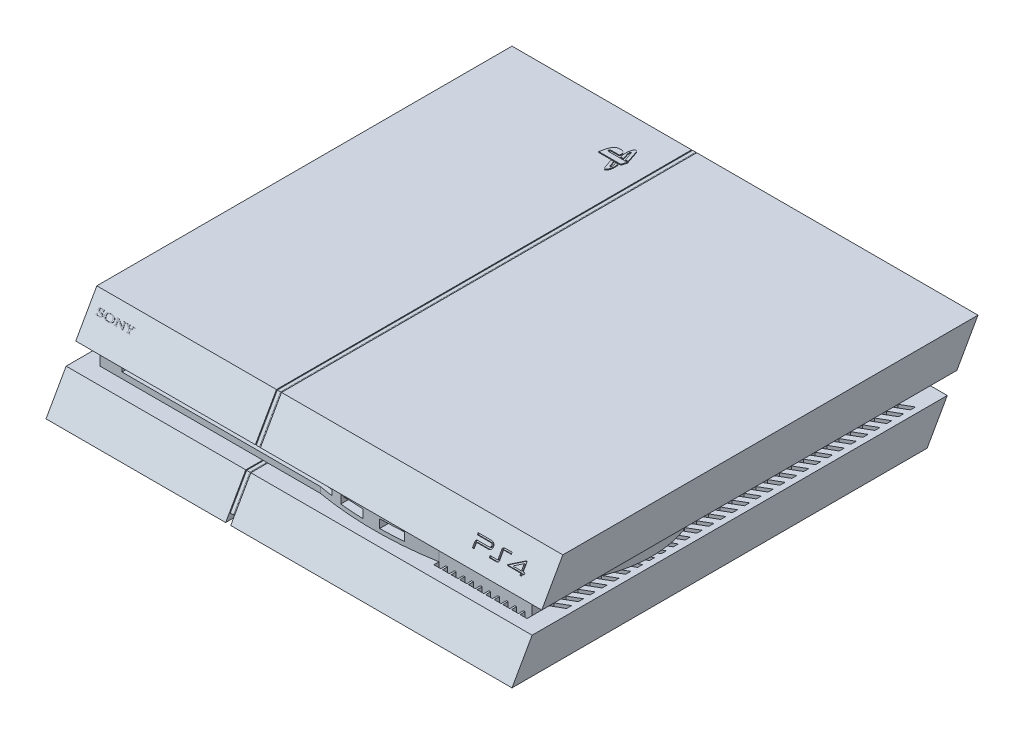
from build123d import *

# Parameters (mm, degrees)
SKETCH1_W               = 275
SKETCH1_H               = 275
BOSS_EXTRUDE1_DEPTH     = 26.5
CUT_EXTRUDE1_DEPTH      = 309.599254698
CUT_EXTRUDE2_DEPTH      = 309.599254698
SKETCH4_W               = 10
SKETCH4_H               = 10
CUT_EXTRUDE3_DEPTH      = 300
BOSS_EXTRUDE2_DEPTH     = 10
FILLET1_R               = 10
BOSS_EXTRUDE9_DEPTH     = 10
CUT_EXTRUDE4_DEPTH      = 20.5
CUT_EXTRUDE4_DEPTH_BACK = 25
SKETCH6_W               = 14
SKETCH6_H               = 5
CUT_EXTRUDE5_DEPTH      = 10.5
CUT_EXTRUDE5_DEPTH_BACK = 150
SKETCH7_W               = 125
SKETCH7_H               = 3
SKETCH8_W               = 3
SKETCH8_H               = 22
SKETCH8_H_2             = 21
CUT_EXTRUDE6_DEPTH      = 187
CUT_EXTRUDE7_DEPTH      = 250
BOSS_EXTRUDE3_DEPTH     = 106
BOSS_EXTRUDE4_DEPTH     = 1.4
BOSS_EXTRUDE4_2_DEPTH   = 1.4
FILLET2_R               = 0.5
FILLET3_R               = 0.5
BOSS_EXTRUDE5_DEPTH     = 0.1
BOSS_EXTRUDE5_2_DEPTH   = 0.1
BOSS_EXTRUDE5_3_DEPTH   = 0.1
BOSS_EXTRUDE5_4_DEPTH   = 0.1
CUT_EXTRUDE8_DEPTH      = 1
SKETCH15_W              = 14
SKETCH15_H              = 2.5
BOSS_EXTRUDE7_DEPTH     = 25
BOSS_EXTRUDE7_2_DEPTH   = 25
BOSS_EXTRUDE8_DEPTH     = 0.5
BOSS_EXTRUDE8_2_DEPTH   = 0.5
BOSS_EXTRUDE8_3_DEPTH   = 0.5
SKETCH18_W              = 4.090909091
SKETCH18_H              = 3
SKETCH18_W_2            = 4.09090909
CUT_EXTRUDE9_DEPTH      = 10.5
CUT_EXTRUDE10_DEPTH     = 10.5
LPATTERN1_COUNT         = 30
LPATTERN1_PITCH         = 7
MIRROR1_COPY_1_DEPTH    = 10.5
MIRROR1_COPY_2_DEPTH    = 10.5
MIRROR1_COPY_3_DEPTH    = 10.5
MIRROR1_COPY_4_DEPTH    = 10.5
MIRROR1_COPY_5_DEPTH    = 10.5
MIRROR1_COPY_6_DEPTH    = 10.5
MIRROR1_COPY_7_DEPTH    = 10.5
MIRROR1_COPY_8_DEPTH    = 10.5
MIRROR1_COPY_9_DEPTH    = 10.5
MIRROR1_COPY_10_DEPTH   = 10.5
MIRROR1_COPY_11_DEPTH   = 10.5
MIRROR1_COPY_12_DEPTH   = 10.5
MIRROR1_COPY_13_DEPTH   = 10.5
MIRROR1_COPY_14_DEPTH   = 10.5
MIRROR1_COPY_15_DEPTH   = 10.5
MIRROR1_COPY_16_DEPTH   = 10.5
MIRROR1_COPY_17_DEPTH   = 10.5
MIRROR1_COPY_18_DEPTH   = 10.5
MIRROR1_COPY_19_DEPTH   = 10.5
MIRROR1_COPY_20_DEPTH   = 10.5
MIRROR1_COPY_21_DEPTH   = 10.5
MIRROR1_COPY_22_DEPTH   = 10.5
MIRROR1_COPY_23_DEPTH   = 10.5
MIRROR1_COPY_24_DEPTH   = 10.5
MIRROR1_COPY_25_DEPTH   = 10.5
MIRROR1_COPY_26_DEPTH   = 10.5
MIRROR1_COPY_27_DEPTH   = 10.5
MIRROR1_COPY_28_DEPTH   = 10.5
MIRROR1_COPY_29_DEPTH   = 10.5
BOSS_EXTRUDE10_DEPTH    = 2
SKETCH21_W              = 150
SKETCH21_H              = 2
BOSS_EXTRUDE11_DEPTH    = 1.25
SKETCH22_W              = 14
SKETCH22_H              = 3
CUT_EXTRUDE11_DEPTH     = 10
LPATTERN2_COUNT         = 16
LPATTERN2_PITCH         = 15.5


with BuildPart() as part:
    # Sketch1 → Boss-Extrude1 (new, symmetric)
    with BuildSketch(Plane(origin=(0, 0, 0), x_dir=(1, 0, 0), z_dir=(0, 1, 0))):
        Rectangle(SKETCH1_W, SKETCH1_H)
    extrude(amount=BOSS_EXTRUDE1_DEPTH, both=True)

    # Sketch2 → Cut-Extrude1 (cut, through all)
    with BuildSketch(Plane(origin=(137.5, 0, 0), x_dir=(0, 0, -1), z_dir=(1, 0, 0))):
        Polygon((-137.5, -26.5), (-107.5, 26.5), (-137.5, 26.5), align=None)
        Polygon((137.5, 26.5), (107.5, -26.5), (137.5, -26.5), align=None)
    extrude(amount=-CUT_EXTRUDE1_DEPTH, mode=Mode.SUBTRACT)

    # Sketch3 → Cut-Extrude2 (cut, through all)
    with BuildSketch(Plane(origin=(137.5, 0, 0), x_dir=(0, 0, -1), z_dir=(1, 0, 0))):
        Polygon((-119.952830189, 4.5), (-115.613207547, 4.5), (-115.613207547, -5.5), (-125.613207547, -5.5), align=None)
        Polygon((125.047169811, 4.5), (119.386792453, -5.5), (115.047169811, -5.5), (115.047169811, 4.5), align=None)
    extrude(amount=-CUT_EXTRUDE2_DEPTH, mode=Mode.SUBTRACT)

    # Sketch4 → Cut-Extrude3 (cut, symmetric)
    with BuildSketch(Plane.XY):
        with Locations((-132.5, -0.5)):
            Rectangle(SKETCH4_W, SKETCH4_H)
        with Locations((132.5, -0.5)):
            Rectangle(SKETCH4_W, SKETCH4_H)
    extrude(amount=CUT_EXTRUDE3_DEPTH, both=True, mode=Mode.SUBTRACT)

    # Sketch5 → Boss-Extrude2 (add)
    with BuildSketch(Plane(origin=(0, -5.5, 0), x_dir=(1, 0, 0), z_dir=(0, 1, 0))):
        with BuildLine():
            Line((127.5, -74.952830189), (127.5, -24.952830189))
            ThreePointArc((127.5, -24.952830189), (132.5, -49.952830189), (127.5, -74.952830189))
        make_face()
    extrude(amount=BOSS_EXTRUDE2_DEPTH)

    # Fillet1
    fillet1_edges = [part.edges().sort_by_distance(p)[0] for p in [
        (127.5, -0.5, 74.952830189),
        (127.5, -0.5, 24.952830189),
    ]]
    fillet(fillet1_edges, radius=FILLET1_R)

    # Sketch17 → Boss-Extrude9 (add)
    with BuildSketch(Plane(origin=(0, -5.5, 0), x_dir=(1, 0, 0), z_dir=(0, 1, 0))):
        with BuildLine():
            Line((2.5, -115.613207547), (72.5, -115.613207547))
            ThreePointArc((72.5, -115.613207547), (37.5, -118.613207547), (2.5, -115.613207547))
        make_face()
    extrude(amount=BOSS_EXTRUDE9_DEPTH)

    # Sketch6 → Cut-Extrude4 (cut, two sides: drawn at the far end of the back side and taken through both)
    with BuildSketch(Plane.XY.offset(115.613207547).offset(-CUT_EXTRUDE4_DEPTH_BACK)):
        with Locations((23.5, -0.5)):
            Rectangle(SKETCH6_W, SKETCH6_H)
        with Locations((47.5, -0.5)):
            Rectangle(SKETCH6_W, SKETCH6_H)
    extrude(amount=CUT_EXTRUDE4_DEPTH + CUT_EXTRUDE4_DEPTH_BACK, mode=Mode.SUBTRACT)

    # Sketch7 → Cut-Extrude5 (cut, two sides: drawn at the far end of the back side and taken through both)
    with BuildSketch(Plane.XY.offset(115.613207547).offset(-CUT_EXTRUDE5_DEPTH_BACK)):
        with Locations((-52, -0.5)):
            Rectangle(SKETCH7_W, SKETCH7_H)
    extrude(amount=CUT_EXTRUDE5_DEPTH + CUT_EXTRUDE5_DEPTH_BACK, mode=Mode.SUBTRACT)

    # Sketch8 → Cut-Extrude6 (cut, symmetric)
    with BuildSketch(Plane.XY):
        with Locations((-30, 15.5)):
            Rectangle(SKETCH8_W, SKETCH8_H)
        with Locations((-30, -16)):
            Rectangle(SKETCH8_W, SKETCH8_H_2)
    extrude(amount=CUT_EXTRUDE6_DEPTH, both=True, mode=Mode.SUBTRACT)

    # Sketch9 → Cut-Extrude7 (cut)
    with BuildSketch(Plane(origin=(-31.5, 0, 0), x_dir=(0, 0, -1), z_dir=(1, 0, 0))):
        Polygon((137.5, 26.5), (-107.5, 26.5), (-119.952830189, 4.5), (-115.613207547, 4.5), (115.047169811, 4.5), (125.047169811, 4.5), align=None)
    extrude(amount=-CUT_EXTRUDE7_DEPTH, mode=Mode.SUBTRACT)

    # Sketch13 → Cut-Extrude8 (cut)
    # profile 1 of 3: a face of its own
    with BuildSketch(Plane(origin=(0, 52.514154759, 92.77500674), x_dir=(1, 0, 0), z_dir=(0, 0.49259821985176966, 0.8702568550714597))):
        with BuildLine():
            Line((92.5, -39.892501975), (100.5, -39.892501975))
            ThreePointArc((100.5, -39.892501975), (102.5, -41.892501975), (100.5, -43.892501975))
            Line((100.5, -43.892501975), (93.7, -43.892501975))
            ThreePointArc((93.7, -43.892501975), (93.558578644, -43.951080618), (93.5, -44.092501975))
            Line((93.5, -44.092501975), (93.5, -46.892501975))
            Line((93.5, -46.892501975), (92.5, -46.892501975))
            Line((92.5, -46.892501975), (92.5, -44.092501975))
            ThreePointArc((92.5, -44.092501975), (92.851471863, -43.243973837), (93.7, -42.892501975))
            Line((93.7, -42.892501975), (100.5, -42.892501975))
            ThreePointArc((100.5, -42.892501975), (101.5, -41.892501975), (100.5, -40.892501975))
            Line((100.5, -40.892501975), (92.5, -40.892501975))
            Line((92.5, -40.892501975), (92.5, -39.892501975))
        make_face()
    # profile 2 of 3: a face of its own
    with BuildSketch(Plane(origin=(0, 52.514154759, 92.77500674), x_dir=(1, 0, 0), z_dir=(0, 0.49259821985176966, 0.8702568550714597))):
        with BuildLine():
            Line((112.5, -39.892501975), (108.2, -39.892501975))
            ThreePointArc((108.2, -39.892501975), (107.351471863, -40.243973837), (107, -41.092501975))
            Line((107, -41.092501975), (107, -45.692501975))
            ThreePointArc((107, -45.692501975), (106.941421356, -45.833923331), (106.8, -45.892501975))
            Line((106.8, -45.892501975), (102.5, -45.892501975))
            Line((102.5, -45.892501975), (102.5, -46.892501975))
            Line((102.5, -46.892501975), (106.8, -46.892501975))
            ThreePointArc((106.8, -46.892501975), (107.648528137, -46.541030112), (108, -45.692501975))
            Line((108, -45.692501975), (108, -41.092501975))
            ThreePointArc((108, -41.092501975), (108.058578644, -40.951080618), (108.2, -40.892501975))
            Line((108.2, -40.892501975), (112.5, -40.892501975))
            Line((112.5, -40.892501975), (112.5, -39.892501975))
        make_face()
    # profile 3 of 3: a face of its own
    with BuildSketch(Plane(origin=(0, 52.514154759, 92.77500674), x_dir=(1, 0, 0), z_dir=(0, 0.49259821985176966, 0.8702568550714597))):
        with BuildLine():
            Line((121.190865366, -39.924902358), (112.590865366, -45.524902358))
            ThreePointArc((112.590865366, -45.524902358), (112.508271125, -45.749423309), (112.7, -45.892501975))
            Line((112.7, -45.892501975), (120.5, -45.892501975))
            Line((120.5, -45.892501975), (120.5, -46.892501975))
            Line((120.5, -46.892501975), (121.5, -46.892501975))
            Line((121.5, -46.892501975), (121.5, -45.892501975))
            Line((121.5, -45.892501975), (122.5, -45.892501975))
            Line((122.5, -45.892501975), (122.5, -44.892501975))
            Line((122.5, -44.892501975), (121.5, -44.892501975))
            Line((121.5, -44.892501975), (121.5, -40.092501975))
            ThreePointArc((121.5, -40.092501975), (121.395323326, -39.916679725), (121.190865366, -39.924902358))
        make_face()
        Polygon((120.5, -41.568088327), (115.39465047, -44.892501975), (120.5, -44.892501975), align=None, mode=Mode.SUBTRACT)
    extrude(amount=-CUT_EXTRUDE8_DEPTH, mode=Mode.SUBTRACT)

    # Sketch18 → Cut-Extrude9 (cut)
    with BuildSketch(Plane(origin=(0, -5.5, 0), x_dir=(1, 0, 0), z_dir=(0, 1, 0))):
        with Locations((74.545454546, -117.113207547)):
            Rectangle(SKETCH18_W, SKETCH18_H)
        with Locations((79.636363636, -117.113207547)):
            Rectangle(SKETCH18_W, SKETCH18_H)
        with Locations((84.727272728, -117.113207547)):
            Rectangle(SKETCH18_W, SKETCH18_H)
        with Locations((89.818181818, -117.113207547)):
            Rectangle(SKETCH18_W, SKETCH18_H)
        with Locations((94.90909091, -117.113207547)):
            Rectangle(SKETCH18_W, SKETCH18_H)
        with Locations((100, -117.113207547)):
            Rectangle(SKETCH18_W_2, SKETCH18_H)
        with Locations((105.090909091, -117.113207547)):
            Rectangle(SKETCH18_W, SKETCH18_H)
        with Locations((110.181818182, -117.113207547)):
            Rectangle(SKETCH18_W, SKETCH18_H)
        with Locations((115.272727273, -117.113207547)):
            Rectangle(SKETCH18_W, SKETCH18_H)
        with Locations((120.363636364, -117.113207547)):
            Rectangle(SKETCH18_W, SKETCH18_H)
        with Locations((125.454545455, -117.113207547)):
            Rectangle(SKETCH18_W, SKETCH18_H)
    extrude(amount=-CUT_EXTRUDE9_DEPTH, mode=Mode.SUBTRACT)

    # Sketch19 → Cut-Extrude10 (cut)
    with BuildSketch(Plane(origin=(0, -5.5, 0), x_dir=(1, 0, 0), z_dir=(0, 1, 0))):
        Polygon((127.5, -102.613207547), (134, -98.860430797), (134, -101.860430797), (127.5, -105.613207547), align=None)
    cut_extrude10 = extrude(amount=-CUT_EXTRUDE10_DEPTH, mode=Mode.SUBTRACT)

    # LPattern1: Cut-Extrude10 ×30
    with Locations(*[(0, 0, -i * LPATTERN1_PITCH) for i in range(1, LPATTERN1_COUNT)]):
        add(cut_extrude10, mode=Mode.SUBTRACT)

    # Mirror1: Cut-Extrude10 across plane
    add(cut_extrude10.mirror(Plane(origin=(0, 0, 0), x_dir=(0, 0, 1), z_dir=(1, 0, 0))), mode=Mode.SUBTRACT)

    # Mirror1 copy 1 sketch → Mirror1 copy 1 (cut)
    with BuildSketch(Plane(origin=(0, -5.5, -7), x_dir=(-1, 0, 0), z_dir=(0, 1, 0))):
        Polygon((127.5, 102.613207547), (134, 98.860430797), (134, 101.860430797), (127.5, 105.613207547), align=None)
    extrude(amount=-MIRROR1_COPY_1_DEPTH, mode=Mode.SUBTRACT)

    # Mirror1 copy 2 sketch → Mirror1 copy 2 (cut)
    with BuildSketch(Plane(origin=(0, -5.5, -14), x_dir=(-1, 0, 0), z_dir=(0, 1, 0))):
        Polygon((127.5, 102.613207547), (134, 98.860430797), (134, 101.860430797), (127.5, 105.613207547), align=None)
    extrude(amount=-MIRROR1_COPY_2_DEPTH, mode=Mode.SUBTRACT)

    # Mirror1 copy 3 sketch → Mirror1 copy 3 (cut)
    with BuildSketch(Plane(origin=(0, -5.5, -21), x_dir=(-1, 0, 0), z_dir=(0, 1, 0))):
        Polygon((127.5, 102.613207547), (134, 98.860430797), (134, 101.860430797), (127.5, 105.613207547), align=None)
    extrude(amount=-MIRROR1_COPY_3_DEPTH, mode=Mode.SUBTRACT)

    # Mirror1 copy 4 sketch → Mirror1 copy 4 (cut)
    with BuildSketch(Plane(origin=(0, -5.5, -28), x_dir=(-1, 0, 0), z_dir=(0, 1, 0))):
        Polygon((127.5, 102.613207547), (134, 98.860430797), (134, 101.860430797), (127.5, 105.613207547), align=None)
    extrude(amount=-MIRROR1_COPY_4_DEPTH, mode=Mode.SUBTRACT)

    # Mirror1 copy 5 sketch → Mirror1 copy 5 (cut)
    with BuildSketch(Plane(origin=(0, -5.5, -35), x_dir=(-1, 0, 0), z_dir=(0, 1, 0))):
        Polygon((127.5, 102.613207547), (134, 98.860430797), (134, 101.860430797), (127.5, 105.613207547), align=None)
    extrude(amount=-MIRROR1_COPY_5_DEPTH, mode=Mode.SUBTRACT)

    # Mirror1 copy 6 sketch → Mirror1 copy 6 (cut)
    with BuildSketch(Plane(origin=(0, -5.5, -42), x_dir=(-1, 0, 0), z_dir=(0, 1, 0))):
        Polygon((127.5, 102.613207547), (134, 98.860430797), (134, 101.860430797), (127.5, 105.613207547), align=None)
    extrude(amount=-MIRROR1_COPY_6_DEPTH, mode=Mode.SUBTRACT)

    # Mirror1 copy 7 sketch → Mirror1 copy 7 (cut)
    with BuildSketch(Plane(origin=(0, -5.5, -49), x_dir=(-1, 0, 0), z_dir=(0, 1, 0))):
        Polygon((127.5, 102.613207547), (134, 98.860430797), (134, 101.860430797), (127.5, 105.613207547), align=None)
    extrude(amount=-MIRROR1_COPY_7_DEPTH, mode=Mode.SUBTRACT)

    # Mirror1 copy 8 sketch → Mirror1 copy 8 (cut)
    with BuildSketch(Plane(origin=(0, -5.5, -56), x_dir=(-1, 0, 0), z_dir=(0, 1, 0))):
        Polygon((127.5, 102.613207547), (134, 98.860430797), (134, 101.860430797), (127.5, 105.613207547), align=None)
    extrude(amount=-MIRROR1_COPY_8_DEPTH, mode=Mode.SUBTRACT)

    # Mirror1 copy 9 sketch → Mirror1 copy 9 (cut)
    with BuildSketch(Plane(origin=(0, -5.5, -63), x_dir=(-1, 0, 0), z_dir=(0, 1, 0))):
        Polygon((127.5, 102.613207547), (134, 98.860430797), (134, 101.860430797), (127.5, 105.613207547), align=None)
    extrude(amount=-MIRROR1_COPY_9_DEPTH, mode=Mode.SUBTRACT)

    # Mirror1 copy 10 sketch → Mirror1 copy 10 (cut)
    with BuildSketch(Plane(origin=(0, -5.5, -70), x_dir=(-1, 0, 0), z_dir=(0, 1, 0))):
        Polygon((127.5, 102.613207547), (134, 98.860430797), (134, 101.860430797), (127.5, 105.613207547), align=None)
    extrude(amount=-MIRROR1_COPY_10_DEPTH, mode=Mode.SUBTRACT)

    # Mirror1 copy 11 sketch → Mirror1 copy 11 (cut)
    with BuildSketch(Plane(origin=(0, -5.5, -77), x_dir=(-1, 0, 0), z_dir=(0, 1, 0))):
        Polygon((127.5, 102.613207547), (134, 98.860430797), (134, 101.860430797), (127.5, 105.613207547), align=None)
    extrude(amount=-MIRROR1_COPY_11_DEPTH, mode=Mode.SUBTRACT)

    # Mirror1 copy 12 sketch → Mirror1 copy 12 (cut)
    with BuildSketch(Plane(origin=(0, -5.5, -84), x_dir=(-1, 0, 0), z_dir=(0, 1, 0))):
        Polygon((127.5, 102.613207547), (134, 98.860430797), (134, 101.860430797), (127.5, 105.613207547), align=None)
    extrude(amount=-MIRROR1_COPY_12_DEPTH, mode=Mode.SUBTRACT)

    # Mirror1 copy 13 sketch → Mirror1 copy 13 (cut)
    with BuildSketch(Plane(origin=(0, -5.5, -91), x_dir=(-1, 0, 0), z_dir=(0, 1, 0))):
        Polygon((127.5, 102.613207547), (134, 98.860430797), (134, 101.860430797), (127.5, 105.613207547), align=None)
    extrude(amount=-MIRROR1_COPY_13_DEPTH, mode=Mode.SUBTRACT)

    # Mirror1 copy 14 sketch → Mirror1 copy 14 (cut)
    with BuildSketch(Plane(origin=(0, -5.5, -98), x_dir=(-1, 0, 0), z_dir=(0, 1, 0))):
        Polygon((127.5, 102.613207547), (134, 98.860430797), (134, 101.860430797), (127.5, 105.613207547), align=None)
    extrude(amount=-MIRROR1_COPY_14_DEPTH, mode=Mode.SUBTRACT)

    # Mirror1 copy 15 sketch → Mirror1 copy 15 (cut)
    with BuildSketch(Plane(origin=(0, -5.5, -105), x_dir=(-1, 0, 0), z_dir=(0, 1, 0))):
        Polygon((127.5, 102.613207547), (134, 98.860430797), (134, 101.860430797), (127.5, 105.613207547), align=None)
    extrude(amount=-MIRROR1_COPY_15_DEPTH, mode=Mode.SUBTRACT)

    # Mirror1 copy 16 sketch → Mirror1 copy 16 (cut)
    with BuildSketch(Plane(origin=(0, -5.5, -112), x_dir=(-1, 0, 0), z_dir=(0, 1, 0))):
        Polygon((127.5, 102.613207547), (134, 98.860430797), (134, 101.860430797), (127.5, 105.613207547), align=None)
    extrude(amount=-MIRROR1_COPY_16_DEPTH, mode=Mode.SUBTRACT)

    # Mirror1 copy 17 sketch → Mirror1 copy 17 (cut)
    with BuildSketch(Plane(origin=(0, -5.5, -119), x_dir=(-1, 0, 0), z_dir=(0, 1, 0))):
        Polygon((127.5, 102.613207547), (134, 98.860430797), (134, 101.860430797), (127.5, 105.613207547), align=None)
    extrude(amount=-MIRROR1_COPY_17_DEPTH, mode=Mode.SUBTRACT)

    # Mirror1 copy 18 sketch → Mirror1 copy 18 (cut)
    with BuildSketch(Plane(origin=(0, -5.5, -126), x_dir=(-1, 0, 0), z_dir=(0, 1, 0))):
        Polygon((127.5, 102.613207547), (134, 98.860430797), (134, 101.860430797), (127.5, 105.613207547), align=None)
    extrude(amount=-MIRROR1_COPY_18_DEPTH, mode=Mode.SUBTRACT)

    # Mirror1 copy 19 sketch → Mirror1 copy 19 (cut)
    with BuildSketch(Plane(origin=(0, -5.5, -133), x_dir=(-1, 0, 0), z_dir=(0, 1, 0))):
        Polygon((127.5, 102.613207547), (134, 98.860430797), (134, 101.860430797), (127.5, 105.613207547), align=None)
    extrude(amount=-MIRROR1_COPY_19_DEPTH, mode=Mode.SUBTRACT)

    # Mirror1 copy 20 sketch → Mirror1 copy 20 (cut)
    with BuildSketch(Plane(origin=(0, -5.5, -140), x_dir=(-1, 0, 0), z_dir=(0, 1, 0))):
        Polygon((127.5, 102.613207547), (134, 98.860430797), (134, 101.860430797), (127.5, 105.613207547), align=None)
    extrude(amount=-MIRROR1_COPY_20_DEPTH, mode=Mode.SUBTRACT)

    # Mirror1 copy 21 sketch → Mirror1 copy 21 (cut)
    with BuildSketch(Plane(origin=(0, -5.5, -147), x_dir=(-1, 0, 0), z_dir=(0, 1, 0))):
        Polygon((127.5, 102.613207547), (134, 98.860430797), (134, 101.860430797), (127.5, 105.613207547), align=None)
    extrude(amount=-MIRROR1_COPY_21_DEPTH, mode=Mode.SUBTRACT)

    # Mirror1 copy 22 sketch → Mirror1 copy 22 (cut)
    with BuildSketch(Plane(origin=(0, -5.5, -154), x_dir=(-1, 0, 0), z_dir=(0, 1, 0))):
        Polygon((127.5, 102.613207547), (134, 98.860430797), (134, 101.860430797), (127.5, 105.613207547), align=None)
    extrude(amount=-MIRROR1_COPY_22_DEPTH, mode=Mode.SUBTRACT)

    # Mirror1 copy 23 sketch → Mirror1 copy 23 (cut)
    with BuildSketch(Plane(origin=(0, -5.5, -161), x_dir=(-1, 0, 0), z_dir=(0, 1, 0))):
        Polygon((127.5, 102.613207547), (134, 98.860430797), (134, 101.860430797), (127.5, 105.613207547), align=None)
    extrude(amount=-MIRROR1_COPY_23_DEPTH, mode=Mode.SUBTRACT)

    # Mirror1 copy 24 sketch → Mirror1 copy 24 (cut)
    with BuildSketch(Plane(origin=(0, -5.5, -168), x_dir=(-1, 0, 0), z_dir=(0, 1, 0))):
        Polygon((127.5, 102.613207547), (134, 98.860430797), (134, 101.860430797), (127.5, 105.613207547), align=None)
    extrude(amount=-MIRROR1_COPY_24_DEPTH, mode=Mode.SUBTRACT)

    # Mirror1 copy 25 sketch → Mirror1 copy 25 (cut)
    with BuildSketch(Plane(origin=(0, -5.5, -175), x_dir=(-1, 0, 0), z_dir=(0, 1, 0))):
        Polygon((127.5, 102.613207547), (134, 98.860430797), (134, 101.860430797), (127.5, 105.613207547), align=None)
    extrude(amount=-MIRROR1_COPY_25_DEPTH, mode=Mode.SUBTRACT)

    # Mirror1 copy 26 sketch → Mirror1 copy 26 (cut)
    with BuildSketch(Plane(origin=(0, -5.5, -182), x_dir=(-1, 0, 0), z_dir=(0, 1, 0))):
        Polygon((127.5, 102.613207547), (134, 98.860430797), (134, 101.860430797), (127.5, 105.613207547), align=None)
    extrude(amount=-MIRROR1_COPY_26_DEPTH, mode=Mode.SUBTRACT)

    # Mirror1 copy 27 sketch → Mirror1 copy 27 (cut)
    with BuildSketch(Plane(origin=(0, -5.5, -189), x_dir=(-1, 0, 0), z_dir=(0, 1, 0))):
        Polygon((127.5, 102.613207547), (134, 98.860430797), (134, 101.860430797), (127.5, 105.613207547), align=None)
    extrude(amount=-MIRROR1_COPY_27_DEPTH, mode=Mode.SUBTRACT)

    # Mirror1 copy 28 sketch → Mirror1 copy 28 (cut)
    with BuildSketch(Plane(origin=(0, -5.5, -196), x_dir=(-1, 0, 0), z_dir=(0, 1, 0))):
        Polygon((127.5, 102.613207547), (134, 98.860430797), (134, 101.860430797), (127.5, 105.613207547), align=None)
    extrude(amount=-MIRROR1_COPY_28_DEPTH, mode=Mode.SUBTRACT)

    # Mirror1 copy 29 sketch → Mirror1 copy 29 (cut)
    with BuildSketch(Plane(origin=(0, -5.5, -203), x_dir=(-1, 0, 0), z_dir=(0, 1, 0))):
        Polygon((127.5, 102.613207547), (134, 98.860430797), (134, 101.860430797), (127.5, 105.613207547), align=None)
    extrude(amount=-MIRROR1_COPY_29_DEPTH, mode=Mode.SUBTRACT)

    # Sketch22 → Cut-Extrude11 (cut)
    with BuildSketch(Plane(origin=(0, 0, -115.047169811), x_dir=(-1, 0, 0), z_dir=(0, 0, -1))):
        with Locations((-117.5, 2)):
            Rectangle(SKETCH22_W, SKETCH22_H)
        with Locations((-117.5, -3)):
            Rectangle(SKETCH22_W, SKETCH22_H)
    cut_extrude11 = extrude(amount=-CUT_EXTRUDE11_DEPTH, mode=Mode.SUBTRACT)

    # LPattern2: Cut-Extrude11 ×16
    with Locations(*[(-i * LPATTERN2_PITCH, 0, 0) for i in range(1, LPATTERN2_COUNT)]):
        add(cut_extrude11, mode=Mode.SUBTRACT)


with BuildPart() as body_2:
    # Sketch10 → Boss-Extrude3 (new body)
    with BuildSketch(Plane.ZY.offset(137.5)):
        Polygon((-125.047169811, 4.5), (-115.047169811, 4.5), (115.613207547, 4.5), (119.952830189, 4.5), (107.5, 26.5), (-137.5, 26.5), align=None)
    extrude(amount=-BOSS_EXTRUDE3_DEPTH)


with BuildPart() as body_3:
    # Sketch11 → Boss-Extrude4 (new, symmetric)
    with BuildSketch(Plane(origin=(-30, 0, 0), x_dir=(0, 0, -1), z_dir=(1, 0, 0))):
        Polygon((-135.235849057, -22.5), (-134.08676302, -22.5), (-125.030159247, -6.5), (117.671668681, -6.5), (106.350913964, -26.5), (107.5, -26.5), (119.386792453, -5.5), (115.047169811, -5.5), (-115.613207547, -5.5), (-125.613207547, -5.5), align=None)
    extrude(amount=BOSS_EXTRUDE4_DEPTH, both=True)

    # Fillet3
    fillet3_edges = [body_3.edges().sort_by_distance(p)[0] for p in [
        (-31.4, -14, 130.424528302),
        (-31.4, -5.5, 3.113207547),
        (-28.6, -14, 130.424528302),
        (-28.6, -5.5, 3.113207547),
    ]]
    fillet(fillet3_edges, radius=FILLET3_R)


with BuildPart() as body_4:
    # Sketch11 → Boss-Extrude4 2 (new, symmetric)
    with BuildSketch(Plane(origin=(-30, 0, 0), x_dir=(0, 0, -1), z_dir=(1, 0, 0))):
        Polygon((125.047169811, 4.5), (137.5, 26.5), (-107.5, 26.5), (-119.952830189, 4.5), (-118.803744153, 4.5), (-106.9169517, 25.5), (135.784876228, 25.5), (123.898083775, 4.5), align=None)
    extrude(amount=BOSS_EXTRUDE4_2_DEPTH, both=True)

    # Fillet2
    fillet2_edges = [body_4.edges().sort_by_distance(p)[0] for p in [
        (-28.6, 26.5, -15),
        (-28.6, 15.5, 113.726415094),
        (-31.4, 15.5, 113.726415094),
        (-31.4, 26.5, -15),
    ]]
    fillet(fillet2_edges, radius=FILLET2_R)


with BuildPart() as body_5:
    # Sketch12 → Boss-Extrude5 (new body)
    with BuildSketch(Plane(origin=(0, 52.514154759, 92.77500674), x_dir=(1, 0, 0), z_dir=(0, 0.49259821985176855, 0.8702568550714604))):
        with BuildLine():
            add(Edge.make_bspline(
                [(-129.817318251, -37.645598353), (-129.88569606, -37.632086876), (-130.019243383, -37.605697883), (-130.21666724, -37.578788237), (-130.405632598, -37.561385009), (-130.528862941, -37.559362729), (-130.589018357, -37.558375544)],
                knots=[0, 0, 0, 0, 1.074937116, 2.099438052, 3.072232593, 4, 4, 4, 4], degree=3))
            add(Edge.make_bspline(
                [(-130.589018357, -37.558375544), (-130.6319025, -37.558715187), (-130.715275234, -37.5593755), (-130.837119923, -37.566973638), (-130.9523699, -37.579210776), (-131.061107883, -37.597136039), (-131.163222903, -37.618793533), (-131.258516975, -37.646370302), (-131.347313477, -37.67868897), (-131.429077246, -37.71594531), (-131.502400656, -37.757927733), (-131.566575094, -37.8037401), (-131.621066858, -37.853507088), (-131.666415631, -37.906954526), (-131.70065233, -37.965406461), (-131.725295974, -38.027445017), (-131.740678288, -38.093538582), (-131.742619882, -38.139037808), (-131.74361181, -38.162282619)],
                knots=[0, 0, 0, 0, 1.430785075, 2.781645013, 4.071820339, 5.296409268, 6.457501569, 7.55296148, 8.603793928, 9.608118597, 10.547335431, 11.418988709, 12.233640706, 13.004201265, 13.748706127, 14.483063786, 15.225022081, 16, 16, 16, 16], degree=3))
            add(Edge.make_bspline(
                [(-131.74361181, -38.162282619), (-131.742445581, -38.188550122), (-131.740140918, -38.240459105), (-131.718303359, -38.315363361), (-131.684012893, -38.385553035), (-131.634613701, -38.449295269), (-131.574116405, -38.508147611), (-131.50428307, -38.563493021), (-131.42543141, -38.615512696), (-131.337205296, -38.662978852), (-131.241326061, -38.707830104), (-131.138466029, -38.749606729), (-131.029754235, -38.789580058), (-130.875450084, -38.839961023), (-130.673958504, -38.897670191), (-130.51115563, -38.944329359), (-130.42861709, -38.967984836)],
                knots=[0, 0, 0, 0, 0.671029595, 1.326066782, 1.98052667, 2.660509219, 3.378626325, 4.137160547, 4.938421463, 5.793723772, 6.699520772, 7.647157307, 8.63498347, 9.664252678, 11.801843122, 14, 14, 14, 14], degree=3))
            add(Edge.make_bspline(
                [(-130.42861709, -38.967984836), (-130.337828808, -38.993205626), (-130.158580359, -39.043000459), (-129.938067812, -39.110581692), (-129.768012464, -39.168258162), (-129.647648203, -39.215920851), (-129.532721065, -39.265646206), (-129.424964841, -39.320190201), (-129.325021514, -39.378705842), (-129.234888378, -39.442889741), (-129.155884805, -39.513649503), (-129.087756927, -39.589616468), (-129.030349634, -39.671090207), (-128.991436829, -39.761205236), (-128.966522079, -39.857603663), (-128.963591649, -39.924320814), (-128.962091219, -39.95848114)],
                knots=[0, 0, 0, 0, 2.087193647, 4.120864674, 5.10816567, 6.063930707, 6.987744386, 7.881116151, 8.737597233, 9.550996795, 10.3278878, 11.08165834, 11.808304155, 12.524295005, 13.244413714, 14, 14, 14, 14], degree=3))
            add(Edge.make_bspline(
                [(-128.962091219, -39.95848114), (-128.963777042, -39.998786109), (-128.967081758, -40.077795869), (-128.993707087, -40.192507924), (-129.037729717, -40.299728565), (-129.100207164, -40.399005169), (-129.179951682, -40.490861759), (-129.276759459, -40.575302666), (-129.391522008, -40.651455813), (-129.522340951, -40.720552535), (-129.668653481, -40.781053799), (-129.828449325, -40.834393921), (-130.00156331, -40.879328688), (-130.188365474, -40.914837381), (-130.388358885, -40.94375831), (-130.60171824, -40.964209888), (-130.828628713, -40.975779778), (-130.984218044, -40.977604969), (-131.064308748, -40.978544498)],
                knots=[0, 0, 0, 0, 0.750033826, 1.470289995, 2.180179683, 2.899616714, 3.644749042, 4.438210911, 5.284607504, 6.204301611, 7.189530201, 8.230023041, 9.339739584, 10.517830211, 11.769723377, 13.102158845, 14.508315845, 16, 16, 16, 16], degree=3))
            add(Edge.make_bspline(
                [(-131.064308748, -40.978544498), (-131.118025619, -40.978025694), (-131.226721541, -40.976975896), (-131.392142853, -40.971256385), (-131.561651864, -40.959698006), (-131.735389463, -40.944965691), (-131.9133508, -40.926506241), (-132.095470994, -40.903569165), (-132.282044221, -40.876288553), (-132.40743382, -40.854867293), (-132.470961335, -40.844014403)],
                knots=[0, 0, 0, 0, 0.911267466, 1.843946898, 2.807327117, 3.793114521, 4.801677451, 5.842170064, 6.906754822, 8, 8, 8, 8], degree=3))
            Line((-132.470961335, -40.844014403), (-132.494614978, -40.824056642))
            Line((-132.494614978, -40.824056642), (-132.299472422, -39.975482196))
            Line((-132.299472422, -39.975482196), (-132.119113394, -39.95848114))
            Line((-132.119113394, -39.95848114), (-131.839704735, -40.66661208))
            add(Edge.make_bspline(
                [(-131.839704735, -40.66661208), (-131.768930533, -40.682861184), (-131.627214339, -40.715397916), (-131.410957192, -40.746696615), (-131.192609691, -40.767868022), (-131.046126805, -40.770336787), (-130.972650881, -40.771575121)],
                knots=[0, 0, 0, 0, 0.995042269, 1.992443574, 2.993008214, 4, 4, 4, 4], degree=3))
            add(Edge.make_bspline(
                [(-130.972650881, -40.771575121), (-130.924341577, -40.771329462), (-130.830359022, -40.770851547), (-130.693562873, -40.761982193), (-130.564904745, -40.750392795), (-130.44465534, -40.73131095), (-130.332457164, -40.709024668), (-130.228091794, -40.681021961), (-130.132386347, -40.647017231), (-130.044497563, -40.608967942), (-129.9664791, -40.565375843), (-129.897236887, -40.518602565), (-129.840209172, -40.465217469), (-129.791706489, -40.409216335), (-129.755296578, -40.34735748), (-129.728049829, -40.281870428), (-129.712259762, -40.211281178), (-129.710364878, -40.162817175), (-129.709398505, -40.138100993)],
                knots=[0, 0, 0, 0, 1.485173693, 2.889307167, 4.213900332, 5.455827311, 6.63116657, 7.730259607, 8.775051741, 9.75204219, 10.671178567, 11.520290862, 12.313839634, 13.066627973, 13.790374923, 14.51074311, 15.240493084, 16, 16, 16, 16], degree=3))
            add(Edge.make_bspline(
                [(-129.709398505, -40.138100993), (-129.710618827, -40.112095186), (-129.713016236, -40.061004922), (-129.733887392, -39.986865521), (-129.768381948, -39.917982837), (-129.816830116, -39.8549735), (-129.875939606, -39.796723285), (-129.943879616, -39.741957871), (-130.021785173, -39.692343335), (-130.108267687, -39.647146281), (-130.202256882, -39.60450239), (-130.30272153, -39.564077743), (-130.409411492, -39.52539146), (-130.561314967, -39.477832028), (-130.758537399, -39.418202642), (-130.918625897, -39.372586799), (-131.000000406, -39.349399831)],
                knots=[0, 0, 0, 0, 0.677448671, 1.330896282, 1.992107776, 2.676082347, 3.394272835, 4.153250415, 4.948519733, 5.799708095, 6.697213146, 7.640250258, 8.624434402, 9.657175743, 11.792501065, 14, 14, 14, 14], degree=3))
            add(Edge.make_bspline(
                [(-131.000000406, -39.349399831), (-131.092066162, -39.324083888), (-131.274530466, -39.273910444), (-131.498442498, -39.203577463), (-131.671847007, -39.144069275), (-131.794157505, -39.094290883), (-131.910661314, -39.041768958), (-132.020706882, -38.986387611), (-132.12255535, -38.925444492), (-132.213729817, -38.85737299), (-132.294626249, -38.782870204), (-132.364400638, -38.70180674), (-132.421694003, -38.613652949), (-132.46209354, -38.517361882), (-132.486307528, -38.414055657), (-132.489361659, -38.342772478), (-132.490919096, -38.306422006)],
                knots=[0, 0, 0, 0, 2.050405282, 4.063680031, 5.039324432, 5.986545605, 6.898296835, 7.783355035, 8.630938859, 9.443699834, 10.222526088, 10.988154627, 11.735293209, 12.470399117, 13.219988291, 14, 14, 14, 14], degree=3))
            add(Edge.make_bspline(
                [(-132.490919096, -38.306422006), (-132.489550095, -38.269785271), (-132.48684991, -38.197523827), (-132.459537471, -38.092958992), (-132.417274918, -37.994535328), (-132.356662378, -37.903278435), (-132.279620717, -37.818426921), (-132.185336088, -37.740855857), (-132.074568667, -37.669540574), (-131.947586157, -37.60553942), (-131.807158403, -37.547714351), (-131.654767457, -37.497277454), (-131.491124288, -37.455649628), (-131.316639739, -37.421168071), (-131.131414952, -37.393674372), (-130.935012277, -37.375058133), (-130.72764767, -37.362794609), (-130.585587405, -37.361617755), (-130.512883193, -37.361015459)],
                knots=[0, 0, 0, 0, 0.729329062, 1.438511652, 2.140592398, 2.857547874, 3.612583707, 4.418611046, 5.285543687, 6.235017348, 7.250777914, 8.312196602, 9.43380884, 10.616369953, 11.858338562, 13.166892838, 14.550060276, 16, 16, 16, 16], degree=3))
            add(Edge.make_bspline(
                [(-130.512883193, -37.361015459), (-130.406420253, -37.362243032), (-130.190655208, -37.364730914), (-129.863506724, -37.382416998), (-129.528666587, -37.41079848), (-129.30375211, -37.43907896), (-129.189757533, -37.453412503)],
                knots=[0, 0, 0, 0, 0.962514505, 1.950697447, 2.961341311, 4, 4, 4, 4], degree=3))
            Line((-129.189757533, -37.453412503), (-129.162408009, -37.471152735))
            Line((-129.162408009, -37.471152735), (-129.398205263, -38.249505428))
            Line((-129.398205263, -38.249505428), (-129.557867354, -38.266506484))
            Line((-129.557867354, -38.266506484), (-129.817318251, -37.645598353))
        make_face()
    extrude(amount=BOSS_EXTRUDE5_DEPTH)


with BuildPart() as body_6:
    # Sketch12 → Boss-Extrude5 2 (new body)
    with BuildSketch(Plane(origin=(0, 52.514154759, 92.77500674), x_dir=(1, 0, 0), z_dir=(0, 0.49259821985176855, 0.8702568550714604))):
        with BuildLine():
            add(Edge.make_bspline(
                [(-122.505385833, -39.089948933), (-122.505856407, -39.125456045), (-122.506789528, -39.195864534), (-122.517194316, -39.299932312), (-122.531359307, -39.401530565), (-122.552931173, -39.500349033), (-122.581478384, -39.596352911), (-122.614262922, -39.690536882), (-122.65432731, -39.781717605), (-122.70125562, -39.869460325), (-122.753021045, -39.955239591), (-122.81179419, -40.037840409), (-122.875935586, -40.118749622), (-122.947141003, -40.196223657), (-123.024382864, -40.270968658), (-123.107084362, -40.343498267), (-123.196299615, -40.413142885), (-123.291216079, -40.480075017), (-123.391687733, -40.543805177), (-123.497622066, -40.602639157), (-123.60804538, -40.658224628), (-123.722966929, -40.710197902), (-123.843584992, -40.756213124), (-123.968120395, -40.800545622), (-124.098466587, -40.838278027), (-124.233260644, -40.873201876), (-124.37298248, -40.904393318), (-124.517818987, -40.930578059), (-124.667367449, -40.953781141), (-124.821714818, -40.972119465), (-124.980986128, -40.985919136), (-125.145112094, -40.996463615), (-125.314214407, -41.002221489), (-125.428577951, -41.003187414), (-125.486484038, -41.003676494)],
                knots=[0, 0, 0, 0, 0.861003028, 1.707317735, 2.534829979, 3.348432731, 4.157941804, 4.963247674, 5.766132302, 6.57090568, 7.375568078, 8.194749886, 9.028305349, 9.878641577, 10.745124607, 11.634616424, 12.545694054, 13.489246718, 14.450986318, 15.430338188, 16.42734951, 17.449308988, 18.488203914, 19.55808253, 20.65496663, 21.778445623, 22.935632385, 24.126697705, 25.348162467, 26.606235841, 27.896273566, 29.22577725, 30.595318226, 32, 32, 32, 32], degree=3))
            add(Edge.make_bspline(
                [(-125.486484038, -41.003676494), (-125.541431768, -41.003120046), (-125.649871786, -41.002021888), (-125.810111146, -40.997243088), (-125.965616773, -40.987385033), (-126.116474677, -40.974218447), (-126.262641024, -40.957216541), (-126.404245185, -40.93685932), (-126.540640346, -40.911270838), (-126.672783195, -40.883786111), (-126.799726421, -40.850655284), (-126.922637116, -40.815909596), (-127.040306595, -40.775536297), (-127.153392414, -40.732246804), (-127.261570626, -40.684674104), (-127.365437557, -40.633881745), (-127.464059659, -40.578324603), (-127.558321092, -40.520059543), (-127.646924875, -40.458114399), (-127.729664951, -40.392730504), (-127.807698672, -40.325750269), (-127.879248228, -40.255360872), (-127.945524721, -40.182864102), (-128.005464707, -40.107064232), (-128.060171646, -40.028912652), (-128.109256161, -39.948023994), (-128.152302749, -39.864309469), (-128.188958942, -39.777629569), (-128.221187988, -39.688723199), (-128.246847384, -39.59702224), (-128.267031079, -39.502730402), (-128.280672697, -39.405635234), (-128.290047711, -39.305971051), (-128.291118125, -39.238545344), (-128.291658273, -39.204521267)],
                knots=[0, 0, 0, 0, 1.413757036, 2.790066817, 4.123835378, 5.422045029, 6.685635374, 7.909352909, 9.101735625, 10.2555295, 11.380973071, 12.476380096, 13.540846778, 14.580350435, 15.590882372, 16.580296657, 17.553742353, 18.501863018, 19.43041239, 20.333334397, 21.214133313, 22.074810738, 22.91399945, 23.739671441, 24.559163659, 25.36692584, 26.172096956, 26.978664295, 27.78672491, 28.603491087, 29.42655516, 30.265672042, 31.124830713, 32, 32, 32, 32], degree=3))
            add(Edge.make_bspline(
                [(-128.291658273, -39.204521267), (-128.291177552, -39.169015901), (-128.290227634, -39.098856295), (-128.280021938, -38.994969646), (-128.264873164, -38.893953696), (-128.243113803, -38.795753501), (-128.216122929, -38.700226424), (-128.181759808, -38.607792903), (-128.142027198, -38.517891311), (-128.094941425, -38.431295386), (-128.042574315, -38.346985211), (-127.98426376, -38.2655583), (-127.919054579, -38.187484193), (-127.848637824, -38.111555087), (-127.771281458, -38.038781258), (-127.687400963, -37.969519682), (-127.598042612, -37.902174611), (-127.502703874, -37.837785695), (-127.401518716, -37.777570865), (-127.29570827, -37.720623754), (-127.185104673, -37.667042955), (-127.069560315, -37.617999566), (-126.94935422, -37.572434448), (-126.824194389, -37.532474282), (-126.694838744, -37.494105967), (-126.560241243, -37.461446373), (-126.421099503, -37.431380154), (-126.276915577, -37.406992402), (-126.128198, -37.384236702), (-125.974817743, -37.366787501), (-125.81654809, -37.353551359), (-125.653628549, -37.344081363), (-125.485790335, -37.33801513), (-125.372409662, -37.337090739), (-125.314995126, -37.33662264)],
                knots=[0, 0, 0, 0, 0.867825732, 1.71484813, 2.549809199, 3.363974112, 4.172435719, 4.974836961, 5.773066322, 6.573588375, 7.382655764, 8.198512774, 9.019977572, 9.86819881, 10.729054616, 11.614536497, 12.526607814, 13.463953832, 14.425816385, 15.404232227, 16.401149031, 17.429478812, 18.472299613, 19.542955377, 20.641054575, 21.770483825, 22.928393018, 24.120843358, 25.345129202, 26.606485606, 27.894223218, 29.22788251, 30.596234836, 32, 32, 32, 32], degree=3))
            add(Edge.make_bspline(
                [(-125.314995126, -37.33662264), (-125.259795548, -37.336748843), (-125.151087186, -37.336997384), (-124.99043411, -37.343673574), (-124.834347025, -37.351785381), (-124.683083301, -37.365585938), (-124.536389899, -37.381611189), (-124.39453099, -37.401174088), (-124.257651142, -37.426114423), (-124.125362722, -37.452960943), (-123.997957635, -37.484269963), (-123.875165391, -37.518497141), (-123.757625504, -37.558228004), (-123.644252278, -37.600083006), (-123.535643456, -37.645778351), (-123.431876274, -37.695511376), (-123.332790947, -37.748497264), (-123.238955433, -37.805517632), (-123.150159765, -37.865456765), (-123.066502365, -37.927773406), (-122.989690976, -37.994209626), (-122.917448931, -38.061877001), (-122.851931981, -38.133303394), (-122.790695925, -38.206075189), (-122.736836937, -38.282928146), (-122.687884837, -38.361746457), (-122.64500718, -38.443646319), (-122.606777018, -38.527732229), (-122.576327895, -38.615341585), (-122.549889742, -38.704991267), (-122.530456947, -38.797507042), (-122.515085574, -38.89239536), (-122.507304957, -38.990275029), (-122.506031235, -39.056428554), (-122.505385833, -39.089948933)],
                knots=[0, 0, 0, 0, 1.430077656, 2.81635127, 4.165556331, 5.47931584, 6.751130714, 7.988923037, 9.188609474, 10.355506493, 11.485820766, 12.587226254, 13.657192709, 14.699529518, 15.718035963, 16.7088763, 17.680003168, 18.628153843, 19.552426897, 20.455128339, 21.32899329, 22.182472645, 23.018194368, 23.838857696, 24.644813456, 25.447399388, 26.241280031, 27.038567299, 27.838177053, 28.642310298, 29.458716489, 30.285786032, 31.131397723, 32, 32, 32, 32], degree=3))
        make_face()
        with BuildLine():
            add(Edge.make_bspline(
                [(-127.416473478, -39.122472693), (-127.415099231, -39.18835295), (-127.412422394, -39.316678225), (-127.386245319, -39.502945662), (-127.346600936, -39.677691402), (-127.288475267, -39.840474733), (-127.213342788, -39.991025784), (-127.123079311, -40.130802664), (-127.014309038, -40.257043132), (-126.890677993, -40.372392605), (-126.74978891, -40.473732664), (-126.593896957, -40.561969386), (-126.422330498, -40.635625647), (-126.236220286, -40.697147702), (-126.034306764, -40.7441648), (-125.817227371, -40.776357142), (-125.585227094, -40.797919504), (-125.425430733, -40.800046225), (-125.343083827, -40.801142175)],
                knots=[0, 0, 0, 0, 1.040574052, 2.026888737, 2.96670172, 3.868290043, 4.751201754, 5.620640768, 6.490707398, 7.377936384, 8.28691126, 9.226812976, 10.203417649, 11.232857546, 12.320943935, 13.475257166, 14.698939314, 16, 16, 16, 16], degree=3))
            add(Edge.make_bspline(
                [(-125.343083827, -40.801142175), (-125.26222966, -40.800139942), (-125.105715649, -40.798199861), (-124.879066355, -40.779567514), (-124.668852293, -40.74904685), (-124.47487363, -40.706175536), (-124.296695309, -40.652467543), (-124.135506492, -40.584290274), (-123.990712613, -40.504060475), (-123.861322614, -40.412035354), (-123.74734428, -40.306172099), (-123.650258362, -40.185129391), (-123.567459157, -40.050860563), (-123.500137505, -39.902501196), (-123.447807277, -39.740265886), (-123.410379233, -39.564203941), (-123.388200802, -39.374115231), (-123.385606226, -39.242773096), (-123.384266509, -39.174954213)],
                knots=[0, 0, 0, 0, 1.324785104, 2.564461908, 3.72366294, 4.803230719, 5.81731611, 6.769007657, 7.6655399, 8.524979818, 9.364876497, 10.206101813, 11.059984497, 11.943529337, 12.869273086, 13.848132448, 14.88887711, 16, 16, 16, 16], degree=3))
            add(Edge.make_bspline(
                [(-123.384266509, -39.174954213), (-123.385818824, -39.111066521), (-123.388844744, -38.986530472), (-123.412594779, -38.805453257), (-123.452515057, -38.635804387), (-123.507830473, -38.477473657), (-123.579233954, -38.330437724), (-123.666843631, -38.194899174), (-123.771449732, -38.07155552), (-123.870725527, -37.978444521), (-123.957586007, -37.910157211), (-124.027412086, -37.861546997), (-124.10222942, -37.817735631), (-124.18079825, -37.776069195), (-124.263607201, -37.737609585), (-124.350950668, -37.702754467), (-124.442845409, -37.672406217), (-124.538285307, -37.642595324), (-124.638786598, -37.619071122), (-124.743260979, -37.59744637), (-124.851941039, -37.57881881), (-124.964939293, -37.564471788), (-125.082218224, -37.552240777), (-125.203796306, -37.544642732), (-125.329725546, -37.539003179), (-125.415023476, -37.538615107), (-125.458395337, -37.538417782)],
                knots=[0, 0, 0, 0, 1.525618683, 2.973883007, 4.35280936, 5.681777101, 6.971476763, 8.24799047, 9.525968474, 10.824993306, 11.491363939, 12.163942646, 12.855312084, 13.560838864, 14.287549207, 15.035051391, 15.805529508, 16.598645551, 17.422246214, 18.269416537, 19.146950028, 20.055032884, 20.989636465, 21.962835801, 22.964153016, 24, 24, 24, 24], degree=3))
            add(Edge.make_bspline(
                [(-125.458395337, -37.538417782), (-125.541220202, -37.539404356), (-125.70093287, -37.541306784), (-125.932012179, -37.559998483), (-126.145412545, -37.590484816), (-126.341825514, -37.632930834), (-126.520371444, -37.6878919), (-126.68173352, -37.755418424), (-126.826098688, -37.834634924), (-126.95238571, -37.92816657), (-127.062681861, -38.03373837), (-127.157603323, -38.151907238), (-127.238209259, -38.282786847), (-127.304062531, -38.426268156), (-127.354998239, -38.582568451), (-127.390907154, -38.751523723), (-127.412320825, -38.932938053), (-127.415063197, -39.058104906), (-127.416473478, -39.122472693)],
                knots=[0, 0, 0, 0, 1.373001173, 2.647582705, 3.840594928, 4.9447966, 5.975891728, 6.933396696, 7.840448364, 8.699167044, 9.531276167, 10.365138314, 11.205221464, 12.073449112, 12.976453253, 13.92514206, 14.932992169, 16, 16, 16, 16], degree=3))
        make_face(mode=Mode.SUBTRACT)
    extrude(amount=BOSS_EXTRUDE5_2_DEPTH)


with BuildPart() as body_7:
    # Sketch12 → Boss-Extrude5 3 (new body)
    with BuildSketch(Plane(origin=(0, 52.514154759, 92.77500674), x_dir=(1, 0, 0), z_dir=(0, 0.49259821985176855, 0.8702568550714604))):
        with BuildLine():
            Line((-120.752798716, -38.12975886), (-120.752798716, -40.145492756))
            add(Edge.make_bspline(
                [(-120.752798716, -40.145492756), (-120.752617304, -40.192554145), (-120.752271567, -40.282244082), (-120.750763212, -40.410616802), (-120.748698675, -40.52642911), (-120.746461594, -40.599595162), (-120.745406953, -40.634088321)],
                knots=[0, 0, 0, 0, 1.155665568, 2.202475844, 3.152581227, 4, 4, 4, 4], degree=3))
            add(Edge.make_bspline(
                [(-120.745406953, -40.634088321), (-120.743637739, -40.645057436), (-120.740193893, -40.666409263), (-120.718134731, -40.693079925), (-120.685139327, -40.710738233), (-120.659152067, -40.716131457), (-120.644878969, -40.719093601)],
                knots=[0, 0, 0, 0, 0.916514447, 1.784032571, 2.782914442, 4, 4, 4, 4], degree=3))
            Line((-120.644878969, -40.719093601), (-120.169588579, -40.80631641))
            Line((-120.169588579, -40.80631641), (-120.161457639, -40.918671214))
            add(Edge.make_bspline(
                [(-120.161457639, -40.918671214), (-120.241043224, -40.917778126), (-120.392577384, -40.916077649), (-120.608648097, -40.912218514), (-120.80232478, -40.912188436), (-120.924041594, -40.911569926), (-120.981204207, -40.911279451)],
                knots=[0, 0, 0, 0, 1.165043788, 2.218290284, 3.163244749, 4, 4, 4, 4], degree=3))
            add(Edge.make_bspline(
                [(-120.981204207, -40.911279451), (-121.00830766, -40.911202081), (-121.064486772, -40.911041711), (-121.151951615, -40.912344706), (-121.245584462, -40.911780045), (-121.345622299, -40.912671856), (-121.452058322, -40.914320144), (-121.565153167, -40.915745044), (-121.684653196, -40.917233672), (-121.766455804, -40.918184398), (-121.808342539, -40.918671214)],
                knots=[0, 0, 0, 0, 0.786374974, 1.629971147, 2.537876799, 3.502999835, 4.53253545, 5.626404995, 6.78460912, 8, 8, 8, 8], degree=3))
            Line((-121.808342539, -40.918671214), (-121.823865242, -40.811490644))
            Line((-121.823865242, -40.811490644), (-121.332312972, -40.719093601))
            add(Edge.make_bspline(
                [(-121.332312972, -40.719093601), (-121.316814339, -40.715525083), (-121.289132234, -40.709151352), (-121.254606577, -40.692521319), (-121.230079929, -40.670069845), (-121.226245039, -40.650790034), (-121.224393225, -40.641480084)],
                knots=[0, 0, 0, 0, 1.33392372, 2.38252103, 3.218942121, 4, 4, 4, 4], degree=3))
            add(Edge.make_bspline(
                [(-121.224393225, -40.641480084), (-121.223426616, -40.605999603), (-121.221386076, -40.531099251), (-121.217764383, -40.412850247), (-121.217903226, -40.282976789), (-121.21731013, -40.192552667), (-121.217001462, -40.145492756)],
                knots=[0, 0, 0, 0, 0.858609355, 1.81254987, 2.861573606, 4, 4, 4, 4], degree=3))
            Line((-121.217001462, -40.145492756), (-121.217001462, -38.122367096))
            add(Edge.make_bspline(
                [(-121.217001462, -38.122367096), (-121.217310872, -38.08245278), (-121.217901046, -38.006319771), (-121.217761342, -37.897384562), (-121.22137444, -37.799096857), (-121.223424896, -37.737009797), (-121.224393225, -37.707689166)],
                knots=[0, 0, 0, 0, 1.154826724, 2.20272933, 3.151238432, 4, 4, 4, 4], degree=3))
            add(Edge.make_bspline(
                [(-121.224393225, -37.707689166), (-121.225979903, -37.697474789), (-121.229129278, -37.677200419), (-121.250438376, -37.651923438), (-121.281485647, -37.633188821), (-121.306653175, -37.626886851), (-121.32048615, -37.623423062)],
                knots=[0, 0, 0, 0, 0.883951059, 1.754541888, 2.765815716, 4, 4, 4, 4], degree=3))
            Line((-121.32048615, -37.623423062), (-121.816473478, -37.525851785))
            Line((-121.816473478, -37.525851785), (-121.823865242, -37.418671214))
            add(Edge.make_bspline(
                [(-121.823865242, -37.418671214), (-121.781978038, -37.419377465), (-121.700666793, -37.420748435), (-121.58191503, -37.423294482), (-121.470043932, -37.424417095), (-121.364595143, -37.426253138), (-121.266032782, -37.426739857), (-121.174128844, -37.427462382), (-121.089125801, -37.428460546), (-121.034671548, -37.428338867), (-121.008553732, -37.428280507)],
                knots=[0, 0, 0, 0, 1.233087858, 2.393664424, 3.496113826, 4.526046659, 5.497885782, 6.397203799, 7.231253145, 8, 8, 8, 8], degree=3))
            add(Edge.make_bspline(
                [(-121.008553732, -37.428280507), (-120.948176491, -37.427965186), (-120.826883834, -37.427331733), (-120.705726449, -37.42156658), (-120.644878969, -37.418671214)],
                knots=[0, 0, 0, 0, 0.995563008, 2, 2, 2, 2], degree=3))
            Line((-120.644878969, -37.418671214), (-117.288279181, -40.03535548))
            Line((-117.288279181, -40.03535548), (-117.288279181, -38.112018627))
            add(Edge.make_bspline(
                [(-117.288279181, -38.112018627), (-117.288457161, -38.073087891), (-117.288799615, -37.998180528), (-117.290391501, -37.890014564), (-117.292209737, -37.790198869), (-117.295049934, -37.726410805), (-117.29641012, -37.695862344)],
                knots=[0, 0, 0, 0, 1.122279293, 2.159398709, 3.11852576, 4, 4, 4, 4], degree=3))
            add(Edge.make_bspline(
                [(-117.29641012, -37.695862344), (-117.298288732, -37.686576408), (-117.302144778, -37.667516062), (-117.325581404, -37.644999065), (-117.358854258, -37.628110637), (-117.385615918, -37.621793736), (-117.400633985, -37.618248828)],
                knots=[0, 0, 0, 0, 0.799245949, 1.640535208, 2.675919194, 4, 4, 4, 4], degree=3))
            Line((-117.400633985, -37.618248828), (-117.872228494, -37.533243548))
            Line((-117.872228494, -37.533243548), (-117.879620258, -37.418671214))
            add(Edge.make_bspline(
                [(-117.879620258, -37.418671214), (-117.837979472, -37.419378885), (-117.756914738, -37.420756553), (-117.638162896, -37.42329962), (-117.525552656, -37.424423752), (-117.419118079, -37.426246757), (-117.318831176, -37.426749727), (-117.224709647, -37.427463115), (-117.136503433, -37.428463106), (-117.079831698, -37.428339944), (-117.052481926, -37.428280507)],
                knots=[0, 0, 0, 0, 1.208310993, 2.352294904, 3.446130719, 4.475634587, 5.440727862, 6.355782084, 7.206500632, 8, 8, 8, 8], degree=3))
            add(Edge.make_bspline(
                [(-117.052481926, -37.428280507), (-116.995565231, -37.428063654), (-116.874092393, -37.427600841), (-116.680669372, -37.426221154), (-116.464580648, -37.423186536), (-116.3130578, -37.420226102), (-116.233474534, -37.418671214)],
                knots=[0, 0, 0, 0, 0.833872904, 1.779669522, 2.833831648, 4, 4, 4, 4], degree=3))
            Line((-116.233474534, -37.418671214), (-116.217212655, -37.525851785))
            Line((-116.217212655, -37.525851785), (-116.721330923, -37.623423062))
            add(Edge.make_bspline(
                [(-116.721330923, -37.623423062), (-116.735200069, -37.626827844), (-116.760229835, -37.632972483), (-116.79072695, -37.652171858), (-116.811961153, -37.677180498), (-116.815102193, -37.697468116), (-116.816684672, -37.707689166)],
                knots=[0, 0, 0, 0, 1.239799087, 2.237475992, 3.11202749, 4, 4, 4, 4], degree=3))
            add(Edge.make_bspline(
                [(-116.816684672, -37.707689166), (-116.818047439, -37.73700544), (-116.820932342, -37.799066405), (-116.82271534, -37.897406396), (-116.824306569, -38.006311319), (-116.824640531, -38.082450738), (-116.824815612, -38.122367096)],
                knots=[0, 0, 0, 0, 0.848998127, 1.797283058, 2.845217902, 4, 4, 4, 4], degree=3))
            Line((-116.824815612, -38.122367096), (-116.824815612, -40.911279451))
            Line((-116.824815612, -40.911279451), (-117.160401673, -40.931237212))
            Line((-117.160401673, -40.931237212), (-120.752798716, -38.12975886))
        make_face()
    extrude(amount=BOSS_EXTRUDE5_3_DEPTH)


with BuildPart() as body_8:
    # Sketch12 → Boss-Extrude5 4 (new body)
    with BuildSketch(Plane(origin=(0, 52.514154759, 92.77500674), x_dir=(1, 0, 0), z_dir=(0, 0.49259821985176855, 0.8702568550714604))):
        with BuildLine():
            Line((-113.29672691, -39.135038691), (-112.373495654, -38.04475358))
            add(Edge.make_bspline(
                [(-112.373495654, -38.04475358), (-112.357440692, -38.025567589), (-112.326666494, -37.988791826), (-112.283033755, -37.935385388), (-112.243266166, -37.886476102), (-112.20672626, -37.842921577), (-112.176873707, -37.802605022), (-112.154931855, -37.765772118), (-112.141064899, -37.732034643), (-112.138753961, -37.710248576), (-112.137698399, -37.700297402)],
                knots=[0, 0, 0, 0, 1.420736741, 2.723272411, 3.916524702, 5.000494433, 5.952109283, 6.760913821, 7.434025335, 8, 8, 8, 8], degree=3))
            add(Edge.make_bspline(
                [(-112.137698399, -37.700297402), (-112.138308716, -37.694042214), (-112.139533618, -37.681488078), (-112.148428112, -37.66388051), (-112.162313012, -37.647875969), (-112.182196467, -37.633861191), (-112.207674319, -37.621810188), (-112.237849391, -37.609711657), (-112.273908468, -37.600390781), (-112.299791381, -37.595650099), (-112.31362237, -37.593116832)],
                knots=[0, 0, 0, 0, 0.676277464, 1.357286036, 2.096085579, 2.956257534, 3.971640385, 5.147243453, 6.475579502, 8, 8, 8, 8], degree=3))
            Line((-112.31362237, -37.593116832), (-112.672862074, -37.533243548))
            Line((-112.672862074, -37.533243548), (-112.680993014, -37.418671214))
            add(Edge.make_bspline(
                [(-112.680993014, -37.418671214), (-112.535379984, -37.42156557), (-112.240970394, -37.427417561), (-111.946503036, -37.427990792), (-111.79767728, -37.428280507)],
                knots=[0, 0, 0, 0, 0.989186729, 2, 2, 2, 2], degree=3))
            add(Edge.make_bspline(
                [(-111.79767728, -37.428280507), (-111.654518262, -37.4279961), (-111.372122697, -37.427435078), (-111.089787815, -37.421565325), (-110.950581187, -37.418671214)],
                knots=[0, 0, 0, 0, 1.013889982, 2, 2, 2, 2], degree=3))
            Line((-110.950581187, -37.418671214), (-110.935058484, -37.525851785))
            Line((-110.935058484, -37.525851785), (-111.338648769, -37.60568283))
            add(Edge.make_bspline(
                [(-111.338648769, -37.60568283), (-111.361187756, -37.61040677), (-111.404332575, -37.61944948), (-111.463995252, -37.63939542), (-111.516218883, -37.662849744), (-111.57510226, -37.701631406), (-111.642356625, -37.760632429), (-111.691908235, -37.812730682), (-111.717846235, -37.840001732)],
                knots=[0, 0, 0, 0, 0.908469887, 1.739020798, 2.478888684, 3.161550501, 4.514201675, 6, 6, 6, 6], degree=3))
            Line((-111.717846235, -37.840001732), (-113.100845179, -39.379706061))
            Line((-113.100845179, -39.379706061), (-113.100845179, -40.138100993))
            add(Edge.make_bspline(
                [(-113.100845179, -40.138100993), (-113.100631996, -40.185654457), (-113.100225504, -40.276328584), (-113.099128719, -40.405701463), (-113.095748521, -40.522721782), (-113.093693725, -40.596636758), (-113.092714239, -40.631870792)],
                knots=[0, 0, 0, 0, 1.155495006, 2.203277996, 3.143532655, 4, 4, 4, 4], degree=3))
            add(Edge.make_bspline(
                [(-113.092714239, -40.631870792), (-113.090201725, -40.642038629), (-113.084768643, -40.664025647), (-113.052906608, -40.688297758), (-113.008353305, -40.705535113), (-112.972922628, -40.712795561), (-112.953009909, -40.716876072)],
                knots=[0, 0, 0, 0, 0.702595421, 1.519298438, 2.605798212, 4, 4, 4, 4], degree=3))
            Line((-112.953009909, -40.716876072), (-112.457022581, -40.811490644))
            Line((-112.457022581, -40.811490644), (-112.448891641, -40.918671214))
            add(Edge.make_bspline(
                [(-112.448891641, -40.918671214), (-112.540303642, -40.917753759), (-112.719432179, -40.915955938), (-112.98281386, -40.912158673), (-113.23512995, -40.91218086), (-113.399719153, -40.911575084), (-113.480042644, -40.911279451)],
                knots=[0, 0, 0, 0, 1.063825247, 2.084643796, 3.06526009, 4, 4, 4, 4], degree=3))
            add(Edge.make_bspline(
                [(-113.480042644, -40.911279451), (-113.562090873, -40.911575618), (-113.728897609, -40.912177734), (-113.983431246, -40.912154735), (-114.246566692, -40.915939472), (-114.424955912, -40.917750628), (-114.515628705, -40.918671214)],
                knots=[0, 0, 0, 0, 0.950721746, 1.932848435, 2.949295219, 4, 4, 4, 4], degree=3))
            Line((-114.515628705, -40.918671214), (-114.531151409, -40.811490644))
            Line((-114.531151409, -40.811490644), (-113.995987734, -40.711701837))
            add(Edge.make_bspline(
                [(-113.995987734, -40.711701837), (-113.981015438, -40.708343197), (-113.954181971, -40.702323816), (-113.919788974, -40.686315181), (-113.89544254, -40.663309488), (-113.890474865, -40.643625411), (-113.888067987, -40.634088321)],
                knots=[0, 0, 0, 0, 1.292114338, 2.315737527, 3.183961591, 4, 4, 4, 4], degree=3))
            add(Edge.make_bspline(
                [(-113.888067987, -40.634088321), (-113.886705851, -40.59885789), (-113.883829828, -40.524472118), (-113.882033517, -40.406672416), (-113.880450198, -40.276577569), (-113.880113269, -40.185655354), (-113.879937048, -40.138100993)],
                knots=[0, 0, 0, 0, 0.852815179, 1.800639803, 2.849685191, 4, 4, 4, 4], degree=3))
            Line((-113.879937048, -40.138100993), (-113.879937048, -39.432187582))
            Line((-113.879937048, -39.432187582), (-115.286589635, -37.910223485))
            add(Edge.make_bspline(
                [(-115.286589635, -37.910223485), (-115.309772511, -37.886342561), (-115.35335933, -37.841443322), (-115.41780203, -37.781875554), (-115.474730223, -37.732041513), (-115.526386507, -37.690309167), (-115.580074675, -37.657912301), (-115.638867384, -37.630943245), (-115.705926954, -37.610757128), (-115.753415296, -37.601101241), (-115.778141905, -37.596073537)],
                knots=[0, 0, 0, 0, 1.339786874, 2.518973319, 3.531493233, 4.386743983, 5.188055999, 6.049269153, 6.984277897, 8, 8, 8, 8], degree=3))
            Line((-115.778141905, -37.596073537), (-116.141816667, -37.525851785))
            Line((-116.141816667, -37.525851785), (-116.149947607, -37.418671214))
            add(Edge.make_bspline(
                [(-116.149947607, -37.418671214), (-116.118409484, -37.41940929), (-116.052378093, -37.420954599), (-115.949393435, -37.423387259), (-115.8382607, -37.424524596), (-115.719505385, -37.426324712), (-115.592608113, -37.426767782), (-115.457832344, -37.427534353), (-115.314925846, -37.428483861), (-115.217107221, -37.428349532), (-115.166843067, -37.428280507)],
                knots=[0, 0, 0, 0, 0.7700776, 1.612312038, 2.514579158, 3.483001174, 4.511511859, 5.612196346, 6.773025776, 8, 8, 8, 8], degree=3))
            add(Edge.make_bspline(
                [(-115.166843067, -37.428280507), (-114.984016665, -37.427945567), (-114.612189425, -37.427264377), (-114.240405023, -37.421567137), (-114.05142596, -37.418671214)],
                knots=[0, 0, 0, 0, 0.983394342, 2, 2, 2, 2], degree=3))
            Line((-114.05142596, -37.418671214), (-114.035903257, -37.525851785))
            Line((-114.035903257, -37.525851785), (-114.411404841, -37.590899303))
            add(Edge.make_bspline(
                [(-114.411404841, -37.590899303), (-114.424272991, -37.592856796), (-114.448497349, -37.596541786), (-114.481233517, -37.605476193), (-114.508712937, -37.614975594), (-114.535514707, -37.62844837), (-114.56153191, -37.650331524), (-114.565521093, -37.674367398), (-114.56737105, -37.685513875)],
                knots=[0, 0, 0, 0, 1.187971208, 2.236361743, 3.097974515, 3.832948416, 4.995044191, 6, 6, 6, 6], degree=3))
            add(Edge.make_bspline(
                [(-114.56737105, -37.685513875), (-114.566567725, -37.694726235), (-114.564797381, -37.715028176), (-114.551719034, -37.745874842), (-114.531979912, -37.779751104), (-114.492976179, -37.830621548), (-114.432018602, -37.901120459), (-114.379749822, -37.958874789), (-114.351531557, -37.99005453)],
                knots=[0, 0, 0, 0, 0.437049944, 0.963158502, 1.571520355, 2.299633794, 4.002289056, 6, 6, 6, 6], degree=3))
            Line((-114.351531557, -37.99005453), (-113.29672691, -39.135038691))
        make_face()
    extrude(amount=BOSS_EXTRUDE5_4_DEPTH)


with BuildPart() as body_9:
    # Sketch15 → Boss-Extrude7 (new body)
    with BuildSketch(Plane.XY.offset(90.613207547)):
        with Locations((23.5, 0.75)):
            Rectangle(SKETCH15_W, SKETCH15_H)
    extrude(amount=BOSS_EXTRUDE7_DEPTH)


with BuildPart() as body_10:
    # Sketch15 → Boss-Extrude7 2 (new body)
    with BuildSketch(Plane.XY.offset(90.613207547)):
        with Locations((47.5, 0.75)):
            Rectangle(SKETCH15_W, SKETCH15_H)
    extrude(amount=BOSS_EXTRUDE7_2_DEPTH)


with BuildPart() as body_11:
    # Sketch16 → Boss-Extrude8 (new body)
    with BuildSketch(Plane(origin=(0, 26.5, 0), x_dir=(1, 0, 0), z_dir=(0, 1, 0))):
        with BuildLine():
            Line((-44.506084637, 108.709795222), (-57.549342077, 108.709795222))
            Line((-57.549342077, 108.709795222), (-56.768995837, 111.969160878))
            ThreePointArc((-56.768995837, 111.969160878), (-56.18404048, 113.671149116), (-55.284904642, 115.230152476))
            ThreePointArc((-55.284904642, 115.230152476), (-54.693348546, 115.798929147), (-53.935615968, 116.114027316))
            ThreePointArc((-53.935615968, 116.114027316), (-53.005816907, 116.260442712), (-52.065835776, 116.309424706))
            ThreePointArc((-52.065835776, 116.309424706), (-51.196722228, 116.207094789), (-50.375143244, 115.905701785))
            ThreePointArc((-50.375143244, 115.905701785), (-49.658895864, 115.214033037), (-49.456617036, 114.239097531))
            ThreePointArc((-49.456617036, 114.239097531), (-49.567816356, 113.609343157), (-49.778182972, 113.005437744))
            Line((-49.778182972, 113.005437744), (-54.521995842, 113.005437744))
            ThreePointArc((-54.521995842, 113.005437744), (-54.985386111, 112.86112805), (-55.284904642, 112.47923215))
            ThreePointArc((-55.284904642, 112.47923215), (-55.271746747, 112.033495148), (-54.947259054, 111.727615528))
            ThreePointArc((-54.947259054, 111.727615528), (-54.766200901, 111.677039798), (-54.578986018, 111.65999437))
            Line((-54.578986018, 111.65999437), (-43.602231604, 111.65999437))
            Line((-43.602231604, 111.65999437), (-44.506084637, 108.709795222))
        make_face()
    extrude(amount=BOSS_EXTRUDE8_DEPTH)


with BuildPart() as body_12:
    # Sketch16 → Boss-Extrude8 2 (new body)
    with BuildSketch(Plane(origin=(0, 26.5, 0), x_dir=(1, 0, 0), z_dir=(0, 1, 0))):
        with BuildLine():
            Line((-45.392262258, 112.368918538), (-43.792860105, 112.368918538))
            Line((-43.792860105, 112.368918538), (-46.146339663, 119.284552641))
            ThreePointArc((-46.146339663, 119.284552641), (-46.433933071, 119.85064673), (-46.868654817, 120.313452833))
            ThreePointArc((-46.868654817, 120.313452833), (-47.41134657, 120.440964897), (-47.852780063, 120.100509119))
            ThreePointArc((-47.852780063, 120.100509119), (-47.875327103, 120.05594238), (-47.897731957, 120.011303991))
            ThreePointArc((-47.897731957, 120.011303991), (-48.618669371, 117.98045089), (-48.825600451, 115.835388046))
            ThreePointArc((-48.825600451, 115.835388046), (-48.663147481, 114.083755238), (-48.270952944, 112.368881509))
            Line((-48.270952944, 112.368881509), (-46.61691377, 112.368881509))
            Line((-46.61691377, 112.368881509), (-47.716563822, 115.600172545))
            ThreePointArc((-47.716563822, 115.600172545), (-47.903761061, 116.451782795), (-47.897731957, 117.323703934))
            ThreePointArc((-47.897731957, 117.323703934), (-47.815630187, 117.580291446), (-47.643745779, 117.787736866))
            ThreePointArc((-47.643745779, 117.787736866), (-47.464871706, 117.835428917), (-47.311439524, 117.731847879))
            ThreePointArc((-47.311439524, 117.731847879), (-47.184997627, 117.492852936), (-47.089679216, 117.239830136))
            Line((-47.089679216, 117.239830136), (-45.392262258, 112.368918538))
        make_face()
    extrude(amount=BOSS_EXTRUDE8_2_DEPTH)


with BuildPart() as body_13:
    # Sketch16 → Boss-Extrude8 3 (new body)
    with BuildSketch(Plane(origin=(0, 26.5, 0), x_dir=(1, 0, 0), z_dir=(0, 1, 0))):
        with BuildLine():
            Line((-49.545419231, 108.032504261), (-47.971231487, 108.032504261))
            Line((-47.971231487, 108.032504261), (-47.089679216, 105.370546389))
            ThreePointArc((-47.089679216, 105.370546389), (-46.917150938, 104.903884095), (-46.713019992, 104.450154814))
            ThreePointArc((-46.713019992, 104.450154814), (-46.435348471, 104.290758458), (-46.183216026, 104.488085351))
            ThreePointArc((-46.183216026, 104.488085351), (-46.062611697, 105.06658342), (-46.06951987, 105.657479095))
            ThreePointArc((-46.06951987, 105.657479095), (-46.318304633, 106.765842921), (-46.783362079, 107.80222403))
            Line((-46.783362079, 107.80222403), (-46.783362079, 107.997153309))
            Line((-46.783362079, 107.997153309), (-45.348188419, 107.997153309))
            ThreePointArc((-45.348188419, 107.997153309), (-45.166455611, 106.486873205), (-45.192273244, 104.9659175))
            ThreePointArc((-45.192273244, 104.9659175), (-45.404897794, 103.718285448), (-45.821865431, 102.523323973))
            ThreePointArc((-45.821865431, 102.523323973), (-46.130268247, 102.033058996), (-46.563931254, 101.649120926))
            ThreePointArc((-46.563931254, 101.649120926), (-46.721272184, 101.597503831), (-46.8830972, 101.632620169))
            ThreePointArc((-46.8830972, 101.632620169), (-47.325649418, 101.979710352), (-47.611715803, 102.463952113))
            Line((-47.611715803, 102.463952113), (-49.545419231, 107.8022019))
            Line((-49.545419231, 107.8022019), (-49.545419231, 108.032504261))
        make_face()
    extrude(amount=BOSS_EXTRUDE8_3_DEPTH)


with BuildPart() as body_14:
    # Sketch20 → Boss-Extrude10 (new body)
    with BuildSketch(Plane(origin=(135.5, 0, 0), x_dir=(0, 0, -1), z_dir=(1, 0, 0))):
        with BuildLine():
            Line((-25, -26.5), (25, -26.5))
            ThreePointArc((25, -26.5), (0, -28), (-25, -26.5))
        make_face()
    extrude(amount=-BOSS_EXTRUDE10_DEPTH)


with BuildPart() as body_15:
    # Sketch21 → Boss-Extrude11 (new, symmetric)
    with BuildSketch(Plane(origin=(-30, 0, 0), x_dir=(0, 0, -1), z_dir=(1, 0, 0))):
        with Locations((-31.9169517, 24.5)):
            Rectangle(SKETCH21_W, SKETCH21_H)
    extrude(amount=BOSS_EXTRUDE11_DEPTH, both=True)


solid = Compound([part.part, body_2.part, body_3.part, body_4.part, body_5.part, body_6.part, body_7.part, body_8.part, body_9.part, body_10.part, body_11.part, body_12.part, body_13.part, body_14.part, body_15.part])
